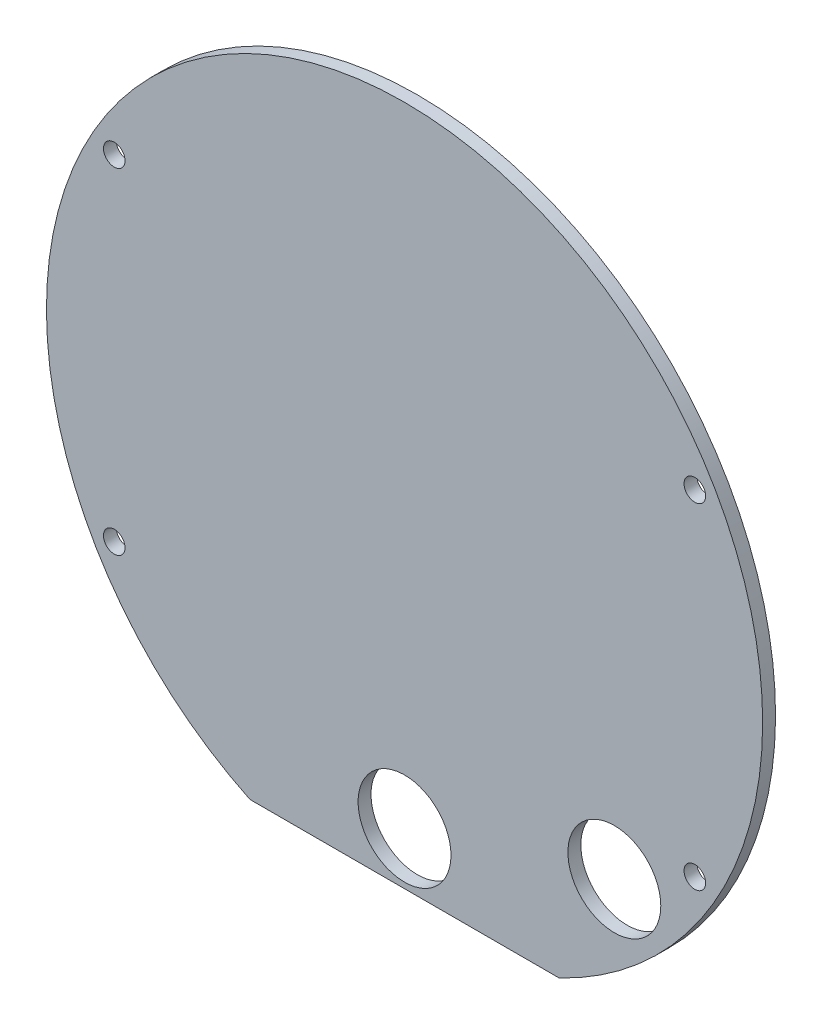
ISO-10303-21;
HEADER;
FILE_DESCRIPTION(('STEP AP214'),'2;1');
FILE_NAME('part.step','',(''),(''),'','','');
FILE_SCHEMA(('AUTOMOTIVE_DESIGN { 1 0 10303 214 1 1 1 1 }'));
ENDSEC;
DATA;
#1=APPLICATION_CONTEXT('core data for automotive mechanical design processes');
#2=APPLICATION_PROTOCOL_DEFINITION('international standard','automotive_design',2000,#1);
#3=PRODUCT_CONTEXT('',#1,'mechanical');
#4=PRODUCT('Part','Part','',(#3));
#5=PRODUCT_RELATED_PRODUCT_CATEGORY('part','',(#4));
#6=PRODUCT_DEFINITION_FORMATION('','',#4);
#7=PRODUCT_DEFINITION_CONTEXT('part definition',#1,'design');
#8=PRODUCT_DEFINITION('design','',#6,#7);
#9=PRODUCT_DEFINITION_SHAPE('','',#8);
#10=(LENGTH_UNIT() NAMED_UNIT(*) SI_UNIT(.MILLI.,.METRE.));
#11=(NAMED_UNIT(*) PLANE_ANGLE_UNIT() SI_UNIT($,.RADIAN.));
#12=(NAMED_UNIT(*) SI_UNIT($,.STERADIAN.) SOLID_ANGLE_UNIT());
#13=UNCERTAINTY_MEASURE_WITH_UNIT(LENGTH_MEASURE(1.E-05),#10,'distance_accuracy_value','');
#14=(GEOMETRIC_REPRESENTATION_CONTEXT(3) GLOBAL_UNCERTAINTY_ASSIGNED_CONTEXT((#13)) GLOBAL_UNIT_ASSIGNED_CONTEXT((#10,
#11,#12)) REPRESENTATION_CONTEXT('',''));
#15=CARTESIAN_POINT('',(0.,0.,0.));
#16=DIRECTION('',(0.,0.,1.));
#17=DIRECTION('',(1.,0.,0.));
#18=AXIS2_PLACEMENT_3D('',#15,#16,#17);
#19=CARTESIAN_POINT('',(0.,0.,3.175));
#20=DIRECTION('',(0.,0.,-1.));
#21=DIRECTION('',(-1.,0.,0.));
#22=AXIS2_PLACEMENT_3D('',#19,#20,#21);
#23=PLANE('',#22);
#24=CARTESIAN_POINT('',(0.,0.,3.175));
#25=DIRECTION('',(0.,0.,-1.));
#26=DIRECTION('',(-1.,0.,0.));
#27=AXIS2_PLACEMENT_3D('',#24,#25,#26);
#28=CIRCLE('',#27,88.138);
#29=CARTESIAN_POINT('',(-38.0491660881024,-79.502,3.175));
#30=VERTEX_POINT('',#29);
#31=CARTESIAN_POINT('',(38.0491660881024,-79.502,3.175));
#32=VERTEX_POINT('',#31);
#33=EDGE_CURVE('E42',#30,#32,#28,.T.);
#34=ORIENTED_EDGE('',*,*,#33,.F.);
#35=DIRECTION('',(1.,0.,0.));
#36=VECTOR('',#35,1.);
#37=CARTESIAN_POINT('',(-38.0491660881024,-79.502,3.175));
#38=LINE('',#37,#36);
#39=EDGE_CURVE('E51',#30,#32,#38,.T.);
#40=ORIENTED_EDGE('',*,*,#39,.T.);
#41=EDGE_LOOP('',(#34,#40));
#42=FACE_BOUND('',#41,.T.);
#43=CARTESIAN_POINT('',(71.4464029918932,-41.2495999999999,3.175));
#44=DIRECTION('',(0.,0.,1.));
#45=DIRECTION('',(1.,0.,0.));
#46=AXIS2_PLACEMENT_3D('',#43,#44,#45);
#47=CIRCLE('',#46,2.6543);
#48=CARTESIAN_POINT('',(74.1007029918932,-41.2495999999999,3.175));
#49=VERTEX_POINT('',#48);
#50=EDGE_CURVE('E54',#49,#49,#47,.F.);
#51=ORIENTED_EDGE('',*,*,#50,.T.);
#52=EDGE_LOOP('',(#51));
#53=FACE_BOUND('',#52,.T.);
#54=CARTESIAN_POINT('',(71.4464029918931,41.2496000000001,3.175));
#55=DIRECTION('',(0.,0.,1.));
#56=DIRECTION('',(1.,0.,0.));
#57=AXIS2_PLACEMENT_3D('',#54,#55,#56);
#58=CIRCLE('',#57,2.6543);
#59=CARTESIAN_POINT('',(74.1007029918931,41.2496000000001,3.175));
#60=VERTEX_POINT('',#59);
#61=EDGE_CURVE('E80',#60,#60,#58,.F.);
#62=ORIENTED_EDGE('',*,*,#61,.T.);
#63=EDGE_LOOP('',(#62));
#64=FACE_BOUND('',#63,.T.);
#65=CARTESIAN_POINT('',(-71.4464029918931,41.2496000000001,3.175));
#66=DIRECTION('',(0.,0.,1.));
#67=DIRECTION('',(1.,0.,0.));
#68=AXIS2_PLACEMENT_3D('',#65,#66,#67);
#69=CIRCLE('',#68,2.6543);
#70=CARTESIAN_POINT('',(-68.7921029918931,41.2496000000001,3.175));
#71=VERTEX_POINT('',#70);
#72=EDGE_CURVE('E83',#71,#71,#69,.F.);
#73=ORIENTED_EDGE('',*,*,#72,.T.);
#74=EDGE_LOOP('',(#73));
#75=FACE_BOUND('',#74,.T.);
#76=CARTESIAN_POINT('',(-71.4464029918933,-41.2495999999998,3.175));
#77=DIRECTION('',(0.,0.,1.));
#78=DIRECTION('',(1.,0.,0.));
#79=AXIS2_PLACEMENT_3D('',#76,#77,#78);
#80=CIRCLE('',#79,2.6543);
#81=CARTESIAN_POINT('',(-68.7921029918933,-41.2495999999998,3.175));
#82=VERTEX_POINT('',#81);
#83=EDGE_CURVE('E86',#82,#82,#80,.F.);
#84=ORIENTED_EDGE('',*,*,#83,.T.);
#85=EDGE_LOOP('',(#84));
#86=FACE_BOUND('',#85,.T.);
#87=CARTESIAN_POINT('',(0.,-66.675,3.175));
#88=DIRECTION('',(0.,0.,1.));
#89=DIRECTION('',(1.,0.,0.));
#90=AXIS2_PLACEMENT_3D('',#87,#88,#89);
#91=CIRCLE('',#90,11.43);
#92=CARTESIAN_POINT('',(11.43,-66.675,3.175));
#93=VERTEX_POINT('',#92);
#94=EDGE_CURVE('E88',#93,#93,#91,.F.);
#95=ORIENTED_EDGE('',*,*,#94,.T.);
#96=EDGE_LOOP('',(#95));
#97=FACE_BOUND('',#96,.T.);
#98=CARTESIAN_POINT('',(51.6364726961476,-51.6364726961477,3.175));
#99=DIRECTION('',(0.,0.,1.));
#100=DIRECTION('',(1.,0.,0.));
#101=AXIS2_PLACEMENT_3D('',#98,#99,#100);
#102=CIRCLE('',#101,11.43);
#103=CARTESIAN_POINT('',(63.0664726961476,-51.6364726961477,3.175));
#104=VERTEX_POINT('',#103);
#105=EDGE_CURVE('E20',#104,#104,#102,.F.);
#106=ORIENTED_EDGE('',*,*,#105,.T.);
#107=EDGE_LOOP('',(#106));
#108=FACE_BOUND('',#107,.T.);
#109=ADVANCED_FACE('F17',(#42,#53,#64,#75,#86,#97,#108),#23,.F.);
#110=CARTESIAN_POINT('',(51.6364726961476,-51.6364726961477,-0.00100000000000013));
#111=DIRECTION('',(0.,0.,1.));
#112=DIRECTION('',(1.,0.,0.));
#113=AXIS2_PLACEMENT_3D('',#110,#111,#112);
#114=CYLINDRICAL_SURFACE('',#113,11.43);
#115=ORIENTED_EDGE('',*,*,#105,.F.);
#116=EDGE_LOOP('',(#115));
#117=FACE_BOUND('',#116,.T.);
#118=CARTESIAN_POINT('',(51.6364726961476,-51.6364726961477,0.));
#119=DIRECTION('',(0.,0.,1.));
#120=DIRECTION('',(1.,0.,0.));
#121=AXIS2_PLACEMENT_3D('',#118,#119,#120);
#122=CIRCLE('',#121,11.43);
#123=CARTESIAN_POINT('',(63.0664726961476,-51.6364726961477,0.));
#124=VERTEX_POINT('',#123);
#125=EDGE_CURVE('E49',#124,#124,#122,.T.);
#126=ORIENTED_EDGE('',*,*,#125,.F.);
#127=EDGE_LOOP('',(#126));
#128=FACE_BOUND('',#127,.T.);
#129=ADVANCED_FACE('F96',(#117,#128),#114,.F.);
#130=CARTESIAN_POINT('',(0.,-66.675,-0.00100000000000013));
#131=DIRECTION('',(0.,0.,1.));
#132=DIRECTION('',(1.,0.,0.));
#133=AXIS2_PLACEMENT_3D('',#130,#131,#132);
#134=CYLINDRICAL_SURFACE('',#133,11.43);
#135=ORIENTED_EDGE('',*,*,#94,.F.);
#136=EDGE_LOOP('',(#135));
#137=FACE_BOUND('',#136,.T.);
#138=CARTESIAN_POINT('',(0.,-66.675,0.));
#139=DIRECTION('',(0.,0.,1.));
#140=DIRECTION('',(1.,0.,0.));
#141=AXIS2_PLACEMENT_3D('',#138,#139,#140);
#142=CIRCLE('',#141,11.43);
#143=CARTESIAN_POINT('',(11.43,-66.675,0.));
#144=VERTEX_POINT('',#143);
#145=EDGE_CURVE('E73',#144,#144,#142,.T.);
#146=ORIENTED_EDGE('',*,*,#145,.F.);
#147=EDGE_LOOP('',(#146));
#148=FACE_BOUND('',#147,.T.);
#149=ADVANCED_FACE('F99',(#137,#148),#134,.F.);
#150=CARTESIAN_POINT('',(-71.4464029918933,-41.2495999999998,3.175));
#151=DIRECTION('',(0.,0.,1.));
#152=DIRECTION('',(1.,0.,0.));
#153=AXIS2_PLACEMENT_3D('',#150,#151,#152);
#154=CYLINDRICAL_SURFACE('',#153,2.6543);
#155=CARTESIAN_POINT('',(-71.4464029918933,-41.2495999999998,0.));
#156=DIRECTION('',(0.,0.,1.));
#157=DIRECTION('',(1.,0.,0.));
#158=AXIS2_PLACEMENT_3D('',#155,#156,#157);
#159=CIRCLE('',#158,2.6543);
#160=CARTESIAN_POINT('',(-68.7921029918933,-41.2495999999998,0.));
#161=VERTEX_POINT('',#160);
#162=EDGE_CURVE('E70',#161,#161,#159,.T.);
#163=ORIENTED_EDGE('',*,*,#162,.F.);
#164=EDGE_LOOP('',(#163));
#165=FACE_BOUND('',#164,.T.);
#166=ORIENTED_EDGE('',*,*,#83,.F.);
#167=EDGE_LOOP('',(#166));
#168=FACE_BOUND('',#167,.T.);
#169=ADVANCED_FACE('F126',(#165,#168),#154,.F.);
#170=CARTESIAN_POINT('',(-71.4464029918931,41.2496000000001,3.175));
#171=DIRECTION('',(0.,0.,1.));
#172=DIRECTION('',(1.,0.,0.));
#173=AXIS2_PLACEMENT_3D('',#170,#171,#172);
#174=CYLINDRICAL_SURFACE('',#173,2.6543);
#175=CARTESIAN_POINT('',(-71.4464029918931,41.2496000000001,0.));
#176=DIRECTION('',(0.,0.,1.));
#177=DIRECTION('',(1.,0.,0.));
#178=AXIS2_PLACEMENT_3D('',#175,#176,#177);
#179=CIRCLE('',#178,2.6543);
#180=CARTESIAN_POINT('',(-68.7921029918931,41.2496000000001,0.));
#181=VERTEX_POINT('',#180);
#182=EDGE_CURVE('E67',#181,#181,#179,.T.);
#183=ORIENTED_EDGE('',*,*,#182,.F.);
#184=EDGE_LOOP('',(#183));
#185=FACE_BOUND('',#184,.T.);
#186=ORIENTED_EDGE('',*,*,#72,.F.);
#187=EDGE_LOOP('',(#186));
#188=FACE_BOUND('',#187,.T.);
#189=ADVANCED_FACE('F122',(#185,#188),#174,.F.);
#190=CARTESIAN_POINT('',(71.4464029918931,41.2496000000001,3.175));
#191=DIRECTION('',(0.,0.,1.));
#192=DIRECTION('',(1.,0.,0.));
#193=AXIS2_PLACEMENT_3D('',#190,#191,#192);
#194=CYLINDRICAL_SURFACE('',#193,2.6543);
#195=CARTESIAN_POINT('',(71.4464029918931,41.2496000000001,0.));
#196=DIRECTION('',(0.,0.,1.));
#197=DIRECTION('',(1.,0.,0.));
#198=AXIS2_PLACEMENT_3D('',#195,#196,#197);
#199=CIRCLE('',#198,2.6543);
#200=CARTESIAN_POINT('',(74.1007029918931,41.2496000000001,0.));
#201=VERTEX_POINT('',#200);
#202=EDGE_CURVE('E64',#201,#201,#199,.T.);
#203=ORIENTED_EDGE('',*,*,#202,.F.);
#204=EDGE_LOOP('',(#203));
#205=FACE_BOUND('',#204,.T.);
#206=ORIENTED_EDGE('',*,*,#61,.F.);
#207=EDGE_LOOP('',(#206));
#208=FACE_BOUND('',#207,.T.);
#209=ADVANCED_FACE('F118',(#205,#208),#194,.F.);
#210=CARTESIAN_POINT('',(71.4464029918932,-41.2495999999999,3.175));
#211=DIRECTION('',(0.,0.,1.));
#212=DIRECTION('',(1.,0.,0.));
#213=AXIS2_PLACEMENT_3D('',#210,#211,#212);
#214=CYLINDRICAL_SURFACE('',#213,2.6543);
#215=CARTESIAN_POINT('',(71.4464029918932,-41.2495999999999,0.));
#216=DIRECTION('',(0.,0.,1.));
#217=DIRECTION('',(1.,0.,0.));
#218=AXIS2_PLACEMENT_3D('',#215,#216,#217);
#219=CIRCLE('',#218,2.6543);
#220=CARTESIAN_POINT('',(74.1007029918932,-41.2495999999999,0.));
#221=VERTEX_POINT('',#220);
#222=EDGE_CURVE('E61',#221,#221,#219,.T.);
#223=ORIENTED_EDGE('',*,*,#222,.F.);
#224=EDGE_LOOP('',(#223));
#225=FACE_BOUND('',#224,.T.);
#226=ORIENTED_EDGE('',*,*,#50,.F.);
#227=EDGE_LOOP('',(#226));
#228=FACE_BOUND('',#227,.T.);
#229=ADVANCED_FACE('F115',(#225,#228),#214,.F.);
#230=CARTESIAN_POINT('',(-38.0491660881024,-79.502,3.175));
#231=DIRECTION('',(0.,1.,0.));
#232=DIRECTION('',(0.,0.,1.));
#233=AXIS2_PLACEMENT_3D('',#230,#231,#232);
#234=PLANE('',#233);
#235=DIRECTION('',(0.,0.,1.));
#236=VECTOR('',#235,1.);
#237=CARTESIAN_POINT('',(38.0491660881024,-79.502,3.175));
#238=LINE('',#237,#236);
#239=CARTESIAN_POINT('',(38.0491660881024,-79.502,0.));
#240=VERTEX_POINT('',#239);
#241=EDGE_CURVE('E46',#32,#240,#238,.F.);
#242=ORIENTED_EDGE('',*,*,#241,.F.);
#243=ORIENTED_EDGE('',*,*,#39,.F.);
#244=DIRECTION('',(0.,0.,-1.));
#245=VECTOR('',#244,1.);
#246=CARTESIAN_POINT('',(-38.0491660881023,-79.502,3.175));
#247=LINE('',#246,#245);
#248=CARTESIAN_POINT('',(-38.0491660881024,-79.502,0.));
#249=VERTEX_POINT('',#248);
#250=EDGE_CURVE('E48',#249,#30,#247,.F.);
#251=ORIENTED_EDGE('',*,*,#250,.F.);
#252=DIRECTION('',(-1.,0.,0.));
#253=VECTOR('',#252,1.);
#254=CARTESIAN_POINT('',(0.,-79.502,0.));
#255=LINE('',#254,#253);
#256=EDGE_CURVE('E11',#240,#249,#255,.T.);
#257=ORIENTED_EDGE('',*,*,#256,.F.);
#258=EDGE_LOOP('',(#242,#243,#251,#257));
#259=FACE_BOUND('',#258,.T.);
#260=ADVANCED_FACE('F56',(#259),#234,.F.);
#261=CARTESIAN_POINT('',(0.,0.,3.175));
#262=DIRECTION('',(0.,0.,-1.));
#263=DIRECTION('',(-1.,0.,0.));
#264=AXIS2_PLACEMENT_3D('',#261,#262,#263);
#265=CYLINDRICAL_SURFACE('',#264,88.138);
#266=CARTESIAN_POINT('',(0.,0.,0.));
#267=DIRECTION('',(0.,0.,-1.));
#268=DIRECTION('',(-1.,0.,0.));
#269=AXIS2_PLACEMENT_3D('',#266,#267,#268);
#270=CIRCLE('',#269,88.138);
#271=EDGE_CURVE('E26',#249,#240,#270,.T.);
#272=ORIENTED_EDGE('',*,*,#271,.F.);
#273=ORIENTED_EDGE('',*,*,#250,.T.);
#274=ORIENTED_EDGE('',*,*,#33,.T.);
#275=ORIENTED_EDGE('',*,*,#241,.T.);
#276=EDGE_LOOP('',(#272,#273,#274,#275));
#277=FACE_BOUND('',#276,.T.);
#278=ADVANCED_FACE('F44',(#277),#265,.T.);
#279=CARTESIAN_POINT('',(0.,0.,0.));
#280=DIRECTION('',(0.,0.,-1.));
#281=DIRECTION('',(-1.,0.,0.));
#282=AXIS2_PLACEMENT_3D('',#279,#280,#281);
#283=PLANE('',#282);
#284=ORIENTED_EDGE('',*,*,#256,.T.);
#285=ORIENTED_EDGE('',*,*,#271,.T.);
#286=EDGE_LOOP('',(#284,#285));
#287=FACE_BOUND('',#286,.T.);
#288=ORIENTED_EDGE('',*,*,#222,.T.);
#289=EDGE_LOOP('',(#288));
#290=FACE_BOUND('',#289,.T.);
#291=ORIENTED_EDGE('',*,*,#202,.T.);
#292=EDGE_LOOP('',(#291));
#293=FACE_BOUND('',#292,.T.);
#294=ORIENTED_EDGE('',*,*,#182,.T.);
#295=EDGE_LOOP('',(#294));
#296=FACE_BOUND('',#295,.T.);
#297=ORIENTED_EDGE('',*,*,#162,.T.);
#298=EDGE_LOOP('',(#297));
#299=FACE_BOUND('',#298,.T.);
#300=ORIENTED_EDGE('',*,*,#145,.T.);
#301=EDGE_LOOP('',(#300));
#302=FACE_BOUND('',#301,.T.);
#303=ORIENTED_EDGE('',*,*,#125,.T.);
#304=EDGE_LOOP('',(#303));
#305=FACE_BOUND('',#304,.T.);
#306=ADVANCED_FACE('F102',(#287,#290,#293,#296,#299,#302,#305),#283,.T.);
#307=CLOSED_SHELL('',(#109,#129,#149,#169,#189,#209,#229,#260,#278,#306));
#308=MANIFOLD_SOLID_BREP('B1',#307);
#309=ADVANCED_BREP_SHAPE_REPRESENTATION('',(#18,#308),#14);
#310=SHAPE_DEFINITION_REPRESENTATION(#9,#309);
ENDSEC;
END-ISO-10303-21;
